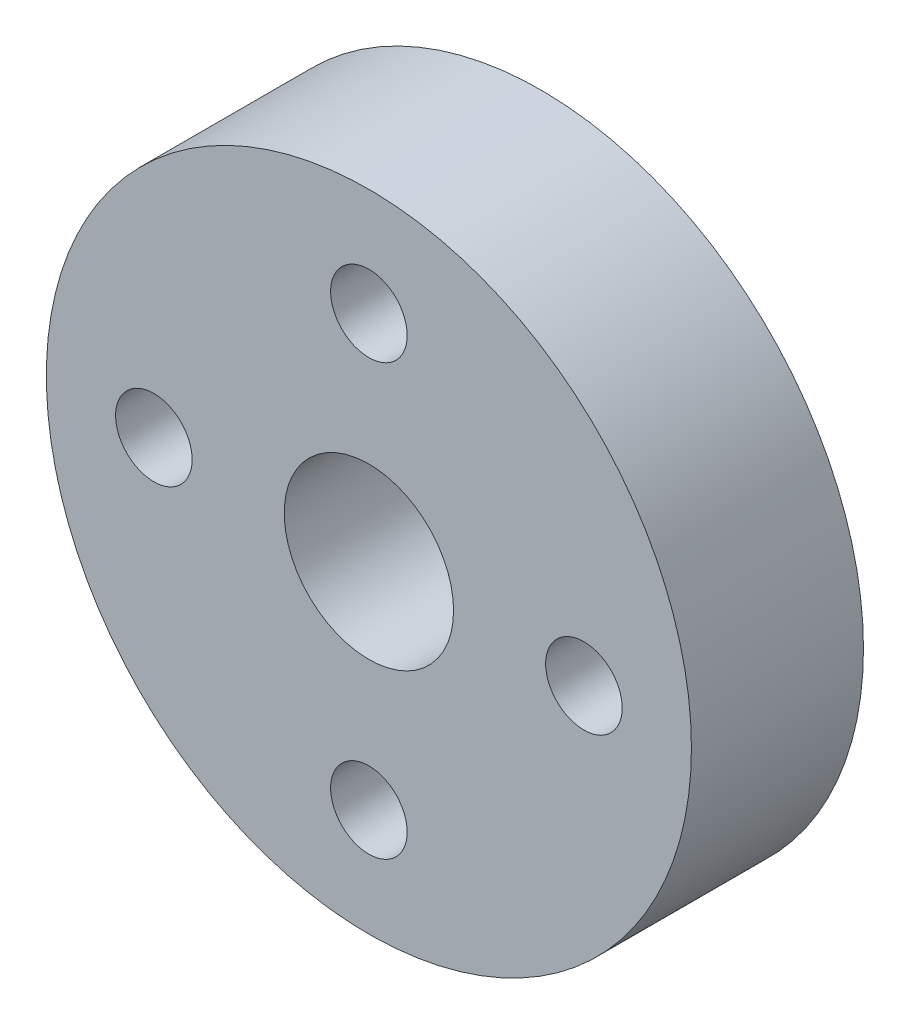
ISO-10303-21;
HEADER;
FILE_DESCRIPTION(('STEP AP214'),'2;1');
FILE_NAME('part.step','',(''),(''),'','','');
FILE_SCHEMA(('AUTOMOTIVE_DESIGN { 1 0 10303 214 1 1 1 1 }'));
ENDSEC;
DATA;
#1=APPLICATION_CONTEXT('core data for automotive mechanical design processes');
#2=APPLICATION_PROTOCOL_DEFINITION('international standard','automotive_design',2000,#1);
#3=PRODUCT_CONTEXT('',#1,'mechanical');
#4=PRODUCT('Part','Part','',(#3));
#5=PRODUCT_RELATED_PRODUCT_CATEGORY('part','',(#4));
#6=PRODUCT_DEFINITION_FORMATION('','',#4);
#7=PRODUCT_DEFINITION_CONTEXT('part definition',#1,'design');
#8=PRODUCT_DEFINITION('design','',#6,#7);
#9=PRODUCT_DEFINITION_SHAPE('','',#8);
#10=(LENGTH_UNIT() NAMED_UNIT(*) SI_UNIT(.MILLI.,.METRE.));
#11=(NAMED_UNIT(*) PLANE_ANGLE_UNIT() SI_UNIT($,.RADIAN.));
#12=(NAMED_UNIT(*) SI_UNIT($,.STERADIAN.) SOLID_ANGLE_UNIT());
#13=UNCERTAINTY_MEASURE_WITH_UNIT(LENGTH_MEASURE(1.E-05),#10,'distance_accuracy_value','');
#14=(GEOMETRIC_REPRESENTATION_CONTEXT(3) GLOBAL_UNCERTAINTY_ASSIGNED_CONTEXT((#13)) GLOBAL_UNIT_ASSIGNED_CONTEXT((#10,
#11,#12)) REPRESENTATION_CONTEXT('',''));
#15=CARTESIAN_POINT('',(0.,0.,0.));
#16=DIRECTION('',(0.,0.,1.));
#17=DIRECTION('',(1.,0.,0.));
#18=AXIS2_PLACEMENT_3D('',#15,#16,#17);
#19=CARTESIAN_POINT('',(0.,0.,5.08));
#20=DIRECTION('',(0.,0.,1.));
#21=DIRECTION('',(1.,0.,0.));
#22=AXIS2_PLACEMENT_3D('',#19,#20,#21);
#23=PLANE('',#22);
#24=CARTESIAN_POINT('',(0.,6.35,5.08));
#25=DIRECTION('',(0.,0.,1.));
#26=DIRECTION('',(1.,0.,0.));
#27=AXIS2_PLACEMENT_3D('',#24,#25,#26);
#28=CIRCLE('',#27,1.13029999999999);
#29=CARTESIAN_POINT('',(1.13029999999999,6.35,5.08));
#30=VERTEX_POINT('',#29);
#31=EDGE_CURVE('E71',#30,#30,#28,.T.);
#32=ORIENTED_EDGE('',*,*,#31,.F.);
#33=EDGE_LOOP('',(#32));
#34=FACE_BOUND('',#33,.T.);
#35=CARTESIAN_POINT('',(6.35,0.,5.08));
#36=DIRECTION('',(0.,0.,1.));
#37=DIRECTION('',(1.,0.,0.));
#38=AXIS2_PLACEMENT_3D('',#35,#36,#37);
#39=CIRCLE('',#38,1.13029999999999);
#40=CARTESIAN_POINT('',(7.48029999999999,0.,5.08));
#41=VERTEX_POINT('',#40);
#42=EDGE_CURVE('E65',#41,#41,#39,.T.);
#43=ORIENTED_EDGE('',*,*,#42,.F.);
#44=EDGE_LOOP('',(#43));
#45=FACE_BOUND('',#44,.T.);
#46=CARTESIAN_POINT('',(0.,-6.35,5.08));
#47=DIRECTION('',(0.,0.,1.));
#48=DIRECTION('',(1.,0.,0.));
#49=AXIS2_PLACEMENT_3D('',#46,#47,#48);
#50=CIRCLE('',#49,1.13029999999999);
#51=CARTESIAN_POINT('',(1.13029999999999,-6.35,5.08));
#52=VERTEX_POINT('',#51);
#53=EDGE_CURVE('E59',#52,#52,#50,.T.);
#54=ORIENTED_EDGE('',*,*,#53,.F.);
#55=EDGE_LOOP('',(#54));
#56=FACE_BOUND('',#55,.T.);
#57=CARTESIAN_POINT('',(-6.35,0.,5.08));
#58=DIRECTION('',(0.,0.,1.));
#59=DIRECTION('',(1.,0.,0.));
#60=AXIS2_PLACEMENT_3D('',#57,#58,#59);
#61=CIRCLE('',#60,1.13029999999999);
#62=CARTESIAN_POINT('',(-5.21970000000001,0.,5.08));
#63=VERTEX_POINT('',#62);
#64=EDGE_CURVE('E53',#63,#63,#61,.T.);
#65=ORIENTED_EDGE('',*,*,#64,.F.);
#66=EDGE_LOOP('',(#65));
#67=FACE_BOUND('',#66,.T.);
#68=CARTESIAN_POINT('',(0.,0.,5.08));
#69=DIRECTION('',(0.,0.,1.));
#70=DIRECTION('',(1.,0.,0.));
#71=AXIS2_PLACEMENT_3D('',#68,#69,#70);
#72=CIRCLE('',#71,9.525);
#73=CARTESIAN_POINT('',(9.525,0.,5.08));
#74=VERTEX_POINT('',#73);
#75=EDGE_CURVE('E10',#74,#74,#72,.T.);
#76=ORIENTED_EDGE('',*,*,#75,.T.);
#77=EDGE_LOOP('',(#76));
#78=FACE_BOUND('',#77,.T.);
#79=CARTESIAN_POINT('',(0.,0.,5.08));
#80=DIRECTION('',(0.,0.,1.));
#81=DIRECTION('',(1.,0.,0.));
#82=AXIS2_PLACEMENT_3D('',#79,#80,#81);
#83=CIRCLE('',#82,2.5);
#84=CARTESIAN_POINT('',(2.5,0.,5.08));
#85=VERTEX_POINT('',#84);
#86=EDGE_CURVE('E43',#85,#85,#83,.T.);
#87=ORIENTED_EDGE('',*,*,#86,.F.);
#88=EDGE_LOOP('',(#87));
#89=FACE_BOUND('',#88,.T.);
#90=ADVANCED_FACE('F32',(#34,#45,#56,#67,#78,#89),#23,.T.);
#91=CARTESIAN_POINT('',(0.,0.,0.));
#92=DIRECTION('',(0.,0.,1.));
#93=DIRECTION('',(1.,0.,0.));
#94=AXIS2_PLACEMENT_3D('',#91,#92,#93);
#95=PLANE('',#94);
#96=CARTESIAN_POINT('',(0.,6.35,0.));
#97=DIRECTION('',(0.,0.,1.));
#98=DIRECTION('',(1.,0.,0.));
#99=AXIS2_PLACEMENT_3D('',#96,#97,#98);
#100=CIRCLE('',#99,1.1303);
#101=CARTESIAN_POINT('',(1.1303,6.35,0.));
#102=VERTEX_POINT('',#101);
#103=EDGE_CURVE('E68',#102,#102,#100,.T.);
#104=ORIENTED_EDGE('',*,*,#103,.T.);
#105=EDGE_LOOP('',(#104));
#106=FACE_BOUND('',#105,.T.);
#107=CARTESIAN_POINT('',(6.35,0.,0.));
#108=DIRECTION('',(0.,0.,1.));
#109=DIRECTION('',(1.,0.,0.));
#110=AXIS2_PLACEMENT_3D('',#107,#108,#109);
#111=CIRCLE('',#110,1.1303);
#112=CARTESIAN_POINT('',(7.4803,0.,0.));
#113=VERTEX_POINT('',#112);
#114=EDGE_CURVE('E62',#113,#113,#111,.T.);
#115=ORIENTED_EDGE('',*,*,#114,.T.);
#116=EDGE_LOOP('',(#115));
#117=FACE_BOUND('',#116,.T.);
#118=CARTESIAN_POINT('',(0.,-6.35,0.));
#119=DIRECTION('',(0.,0.,1.));
#120=DIRECTION('',(1.,0.,0.));
#121=AXIS2_PLACEMENT_3D('',#118,#119,#120);
#122=CIRCLE('',#121,1.1303);
#123=CARTESIAN_POINT('',(1.1303,-6.35,0.));
#124=VERTEX_POINT('',#123);
#125=EDGE_CURVE('E56',#124,#124,#122,.T.);
#126=ORIENTED_EDGE('',*,*,#125,.T.);
#127=EDGE_LOOP('',(#126));
#128=FACE_BOUND('',#127,.T.);
#129=CARTESIAN_POINT('',(-6.35,0.,0.));
#130=DIRECTION('',(0.,0.,1.));
#131=DIRECTION('',(1.,0.,0.));
#132=AXIS2_PLACEMENT_3D('',#129,#130,#131);
#133=CIRCLE('',#132,1.1303);
#134=CARTESIAN_POINT('',(-5.2197,0.,0.));
#135=VERTEX_POINT('',#134);
#136=EDGE_CURVE('E48',#135,#135,#133,.T.);
#137=ORIENTED_EDGE('',*,*,#136,.T.);
#138=EDGE_LOOP('',(#137));
#139=FACE_BOUND('',#138,.T.);
#140=CARTESIAN_POINT('',(0.,0.,0.));
#141=DIRECTION('',(0.,0.,1.));
#142=DIRECTION('',(1.,0.,0.));
#143=AXIS2_PLACEMENT_3D('',#140,#141,#142);
#144=CIRCLE('',#143,9.525);
#145=CARTESIAN_POINT('',(9.525,0.,0.));
#146=VERTEX_POINT('',#145);
#147=EDGE_CURVE('E36',#146,#146,#144,.T.);
#148=ORIENTED_EDGE('',*,*,#147,.F.);
#149=EDGE_LOOP('',(#148));
#150=FACE_BOUND('',#149,.T.);
#151=CARTESIAN_POINT('',(0.,0.,0.));
#152=DIRECTION('',(0.,0.,1.));
#153=DIRECTION('',(1.,0.,0.));
#154=AXIS2_PLACEMENT_3D('',#151,#152,#153);
#155=CIRCLE('',#154,2.5);
#156=CARTESIAN_POINT('',(2.5,0.,0.));
#157=VERTEX_POINT('',#156);
#158=EDGE_CURVE('E45',#157,#157,#155,.T.);
#159=ORIENTED_EDGE('',*,*,#158,.T.);
#160=EDGE_LOOP('',(#159));
#161=FACE_BOUND('',#160,.T.);
#162=ADVANCED_FACE('F79',(#106,#117,#128,#139,#150,#161),#95,.F.);
#163=CARTESIAN_POINT('',(0.,0.,5.08));
#164=DIRECTION('',(0.,0.,-1.));
#165=DIRECTION('',(-1.,0.,0.));
#166=AXIS2_PLACEMENT_3D('',#163,#164,#165);
#167=CYLINDRICAL_SURFACE('',#166,9.525);
#168=ORIENTED_EDGE('',*,*,#75,.F.);
#169=EDGE_LOOP('',(#168));
#170=FACE_BOUND('',#169,.T.);
#171=ORIENTED_EDGE('',*,*,#147,.T.);
#172=EDGE_LOOP('',(#171));
#173=FACE_BOUND('',#172,.T.);
#174=ADVANCED_FACE('F34',(#170,#173),#167,.T.);
#175=CARTESIAN_POINT('',(0.,0.,5.08));
#176=DIRECTION('',(0.,0.,-1.));
#177=DIRECTION('',(-1.,0.,0.));
#178=AXIS2_PLACEMENT_3D('',#175,#176,#177);
#179=CYLINDRICAL_SURFACE('',#178,2.5);
#180=ORIENTED_EDGE('',*,*,#86,.T.);
#181=EDGE_LOOP('',(#180));
#182=FACE_BOUND('',#181,.T.);
#183=ORIENTED_EDGE('',*,*,#158,.F.);
#184=EDGE_LOOP('',(#183));
#185=FACE_BOUND('',#184,.T.);
#186=ADVANCED_FACE('F89',(#182,#185),#179,.F.);
#187=CARTESIAN_POINT('',(-6.35,0.,5.08));
#188=DIRECTION('',(0.,0.,1.));
#189=DIRECTION('',(1.,0.,0.));
#190=AXIS2_PLACEMENT_3D('',#187,#188,#189);
#191=CYLINDRICAL_SURFACE('',#190,1.13029999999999);
#192=ORIENTED_EDGE('',*,*,#136,.F.);
#193=EDGE_LOOP('',(#192));
#194=FACE_BOUND('',#193,.T.);
#195=ORIENTED_EDGE('',*,*,#64,.T.);
#196=EDGE_LOOP('',(#195));
#197=FACE_BOUND('',#196,.T.);
#198=ADVANCED_FACE('F92',(#194,#197),#191,.F.);
#199=CARTESIAN_POINT('',(0.,-6.35,5.08));
#200=DIRECTION('',(0.,0.,1.));
#201=DIRECTION('',(1.,0.,0.));
#202=AXIS2_PLACEMENT_3D('',#199,#200,#201);
#203=CYLINDRICAL_SURFACE('',#202,1.13029999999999);
#204=ORIENTED_EDGE('',*,*,#125,.F.);
#205=EDGE_LOOP('',(#204));
#206=FACE_BOUND('',#205,.T.);
#207=ORIENTED_EDGE('',*,*,#53,.T.);
#208=EDGE_LOOP('',(#207));
#209=FACE_BOUND('',#208,.T.);
#210=ADVANCED_FACE('F106',(#206,#209),#203,.F.);
#211=CARTESIAN_POINT('',(6.35,0.,5.08));
#212=DIRECTION('',(0.,0.,1.));
#213=DIRECTION('',(1.,0.,0.));
#214=AXIS2_PLACEMENT_3D('',#211,#212,#213);
#215=CYLINDRICAL_SURFACE('',#214,1.13029999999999);
#216=ORIENTED_EDGE('',*,*,#114,.F.);
#217=EDGE_LOOP('',(#216));
#218=FACE_BOUND('',#217,.T.);
#219=ORIENTED_EDGE('',*,*,#42,.T.);
#220=EDGE_LOOP('',(#219));
#221=FACE_BOUND('',#220,.T.);
#222=ADVANCED_FACE('F110',(#218,#221),#215,.F.);
#223=CARTESIAN_POINT('',(0.,6.35,5.08));
#224=DIRECTION('',(0.,0.,1.));
#225=DIRECTION('',(1.,0.,0.));
#226=AXIS2_PLACEMENT_3D('',#223,#224,#225);
#227=CYLINDRICAL_SURFACE('',#226,1.13029999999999);
#228=ORIENTED_EDGE('',*,*,#103,.F.);
#229=EDGE_LOOP('',(#228));
#230=FACE_BOUND('',#229,.T.);
#231=ORIENTED_EDGE('',*,*,#31,.T.);
#232=EDGE_LOOP('',(#231));
#233=FACE_BOUND('',#232,.T.);
#234=ADVANCED_FACE('F75',(#230,#233),#227,.F.);
#235=CLOSED_SHELL('',(#90,#162,#174,#186,#198,#210,#222,#234));
#236=MANIFOLD_SOLID_BREP('B2',#235);
#237=ADVANCED_BREP_SHAPE_REPRESENTATION('',(#18,#236),#14);
#238=SHAPE_DEFINITION_REPRESENTATION(#9,#237);
ENDSEC;
END-ISO-10303-21;
